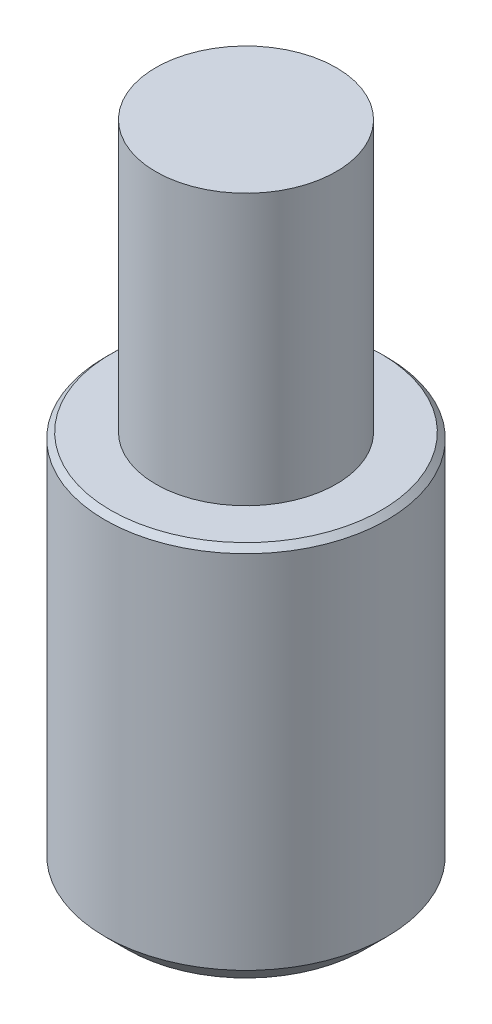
from build123d import *

# Parameters (mm, degrees)
SKETCH1_R      = 3.175
EXTRUDE1_DEPTH = 8.763
SKETCH2_R      = 2.032
EXTRUDE2_DEPTH = 6.096
CHAMFER1_SIZE  = 0.127
EXTRUDE3_DEPTH = 3.175
CHAMFER2_SIZE  = 0.508


with BuildPart() as part:
    # Sketch1 → Extrude1 (new body)
    with BuildSketch(Plane(origin=(0, 0, 0), x_dir=(1, 0, 0), z_dir=(0, 1, 0))):
        with Locations(Location((0, 0, 0), (0, 0, 270))):
            Circle(SKETCH1_R)
    extrude(amount=EXTRUDE1_DEPTH)

    # Sketch2 → Extrude2 (add)
    with BuildSketch(Plane(origin=(0, 8.763, 0), x_dir=(1, 0, 0), z_dir=(0, 1, 0))):
        with Locations(Location((0, 0, 0), (0, 0, 90))):
            Circle(SKETCH2_R)
    extrude(amount=EXTRUDE2_DEPTH)

    # Chamfer1
    chamfer1_edges = [part.edges().sort_by_distance(p)[0] for p in [
        (0, 8.763, -3.175),
    ]]
    chamfer(chamfer1_edges, length=CHAMFER1_SIZE)

    # Sketch3 → Extrude3 (cut)
    with BuildSketch(Plane.XZ):
        Polygon((0.916543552, 1.5875), (-0.916543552, 1.5875), (-1.833087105, 0), (-0.916543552, -1.5875), (0.916543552, -1.5875), (1.833087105, 0), align=None)
    extrude(amount=-EXTRUDE3_DEPTH, mode=Mode.SUBTRACT)

    # Chamfer2
    chamfer2_edges = [part.edges().sort_by_distance(p)[0] for p in [
        (0, 0, -3.175),
    ]]
    chamfer(chamfer2_edges, length=CHAMFER2_SIZE)


solid = part.part
